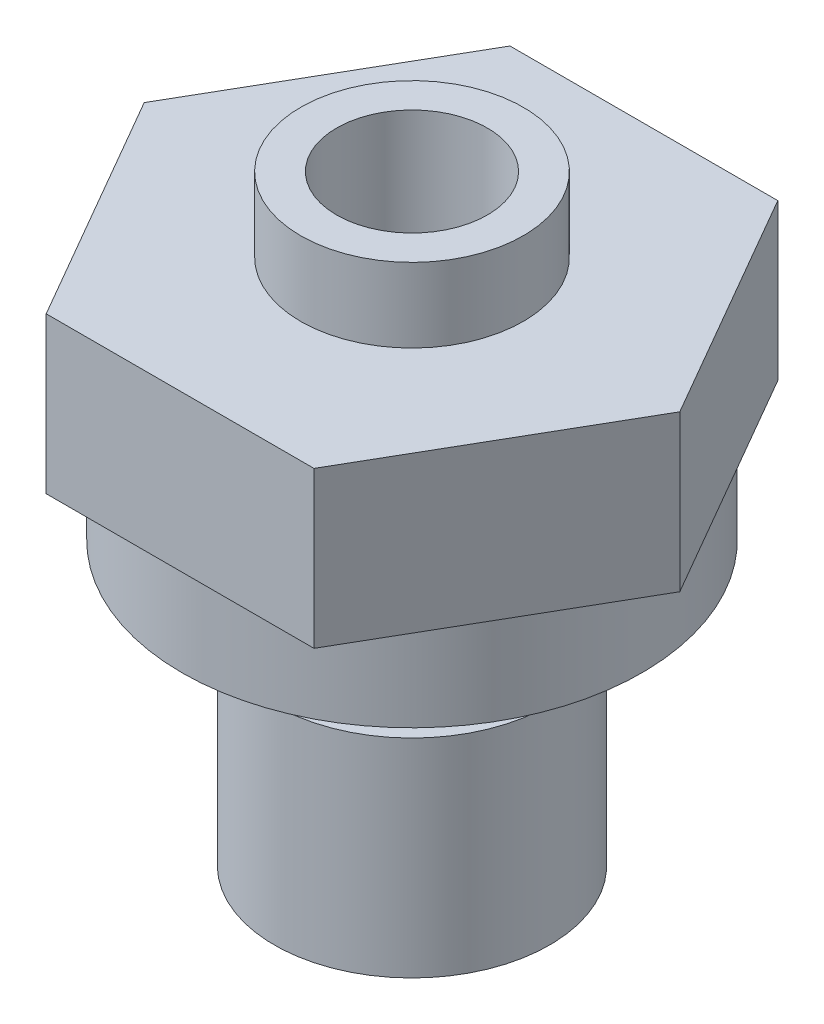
from build123d import *

# Parameters (mm, degrees)
EXTRUDE1_DEPTH     = 5.334
SKETCH2_R          = 7.874
EXTRUDE2_DEPTH     = 3.048
SKETCH3_R          = 6.985
SKETCH3_R_2        = 4.826
CUT_EXTRUDE1_DEPTH = 1.27
SKETCH4_R          = 3.9751
EXTRUDE3_DEPTH     = 2.54
SKETCH5_R          = 4.7117
EXTRUDE4_DEPTH     = 7.112
SKETCH7_R          = 3.81
EXTRUDE5_DEPTH     = 2.54
SKETCH8_R          = 1.524
CUT_EXTRUDE2_DEPTH = 24.880925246
SKETCH9_R          = 2.58064
CUT_EXTRUDE3_DEPTH = 3.81
CHAMFER1_SIZE      = 0.508
CHAMFER1_SIZE2     = 1.016
CHAMFER2_SIZE      = 4.064
CHAMFER2_SIZE2     = 2.346351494


with BuildPart() as part:
    # Sketch1 → Extrude1 (new body)
    with BuildSketch(Plane(origin=(0, 0, 0), x_dir=(1, 0, 0), z_dir=(0, 1, 0))):
        Polygon((0, 7.9375), (4.582717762, 7.9375), (6.874076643, 3.96875), (9.165435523, 0), (6.874076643, -3.96875), (4.582717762, -7.9375), (0, -7.9375), (-4.582717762, -7.9375), (-6.874076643, -3.96875), (-9.165435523, 0), (-6.874076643, 3.96875), (-4.582717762, 7.9375), align=None)
    extrude(amount=EXTRUDE1_DEPTH)

    # Sketch2 → Extrude2 (add)
    with BuildSketch(Plane.XZ):
        with Locations(Location((0, 0, 0), (0, 0, 90))):
            Circle(SKETCH2_R)
    extrude(amount=EXTRUDE2_DEPTH)

    # Sketch3 → Cut-Extrude1 (cut)
    with BuildSketch(Plane.XZ.offset(3.048)):
        with Locations(Location((0, 0, 0), (0, 0, 270))):
            Circle(SKETCH3_R)
        with Locations(Location((0, 0, 0), (0, 0, 270))):
            Circle(SKETCH3_R_2, mode=Mode.SUBTRACT)
    extrude(amount=-CUT_EXTRUDE1_DEPTH, mode=Mode.SUBTRACT)

    # Sketch4 → Extrude3 (add)
    with BuildSketch(Plane.XZ.offset(3.048)):
        with Locations(Location((0, 0, 0), (0, 0, 270))):
            Circle(SKETCH4_R)
    extrude(amount=EXTRUDE3_DEPTH)

    # Sketch5 → Extrude4 (add)
    with BuildSketch(Plane.XZ.offset(5.588)):
        with Locations(Location((0, 0, 0), (0, 0, 270))):
            Circle(SKETCH5_R)
    extrude(amount=EXTRUDE4_DEPTH)

    # Sketch7 → Extrude5 (add)
    with BuildSketch(Plane(origin=(0, 5.334, 0), x_dir=(-1, 0, 0), z_dir=(0, 1, 0))):
        with Locations(Location((0, 0, 0), (0, 0, 90))):
            Circle(SKETCH7_R)
    extrude(amount=EXTRUDE5_DEPTH)

    # Sketch8 → Cut-Extrude2 (cut, through all)
    with BuildSketch(Plane(origin=(0, 7.874, 0), x_dir=(-1, 0, 0), z_dir=(0, 1, 0))):
        with Locations(Location((0, 0, 0), (0, 0, 90))):
            Circle(SKETCH8_R)
    extrude(amount=-CUT_EXTRUDE2_DEPTH, mode=Mode.SUBTRACT)

    # Sketch9 → Cut-Extrude3 (cut)
    with BuildSketch(Plane(origin=(0, 7.874, 0), x_dir=(-1, 0, 0), z_dir=(0, 1, 0))):
        with Locations(Location((0, 0, 0), (0, 0, 90))):
            Circle(SKETCH9_R)
    extrude(amount=-CUT_EXTRUDE3_DEPTH, mode=Mode.SUBTRACT)

    # Chamfer1
    chamfer1_edges = [part.edges().sort_by_distance(p)[0] for p in [
        (0, 4.064, -1.524),
    ]]
    chamfer1_side = [part.faces().sort_by_distance(p)[0] for p in [
        (0, -4.318, -1.524),
    ]]
    chamfer(chamfer1_edges, length=CHAMFER1_SIZE, length2=CHAMFER1_SIZE2, reference=chamfer1_side[0])

    # Chamfer2
    chamfer2_edges = [part.edges().sort_by_distance(p)[0] for p in [
        (0, -12.7, -1.524),
    ]]
    chamfer2_side = [part.faces().sort_by_distance(p)[0] for p in [
        (0, -4.572, -1.524),
    ]]
    chamfer(chamfer2_edges, length=CHAMFER2_SIZE, length2=CHAMFER2_SIZE2, reference=chamfer2_side[0])


solid = part.part
